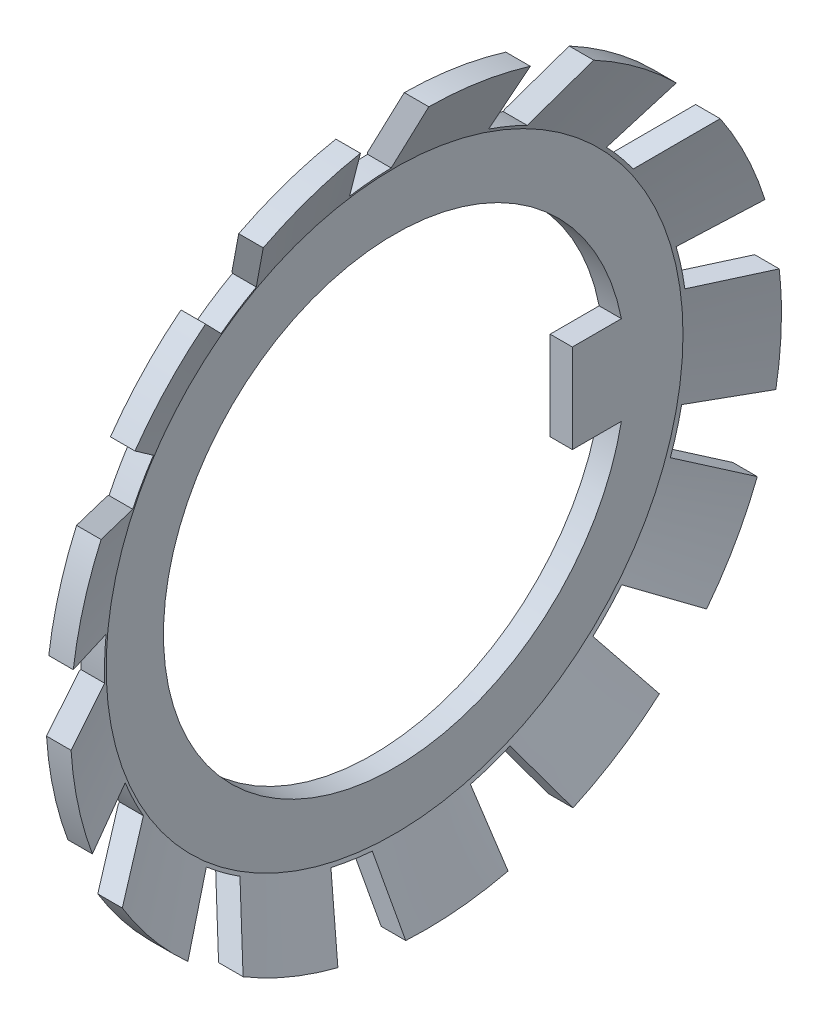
from build123d import *

# Parameters (mm, degrees)
ESQUISSE2_R                  = 13
ENL_V_MAT_EXTRU_1_DEPTH      = 29.444119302
ESQUISSE4_W                  = 4
ESQUISSE4_H                  = 5
BOSS_EXTRU_1_DEPTH           = 1.25
ENL_V_MAT_EXTRU_6_DEPTH      = 29.444119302
R_P_TITION_CIRCULAIRE3_COUNT = 13
R_P_TITION_CIRCULAIRE3_ANGLE = 332.28


with BuildPart() as part:
    # Esquisse1 → Base-R_volution (revolve)
    with BuildSketch(Plane.XY, mode=Mode.PRIVATE) as base_r_volution_sk:
        Polygon((0, 0), (0, 16.5), (1.632076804, 20), (3.011299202, 20), (1.25, 16.222881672), (1.25, 0), align=None)
    revolve(base_r_volution_sk.sketch.rotate(Axis((0, 0, 0), (-1, 0, 0)), 90), axis=Axis((0, 0, 0), (-1, 0, 0)))

    # Esquisse2 → Enl_v. mat.-Extru.1 (cut, through all)
    with BuildSketch(Plane.ZY):
        Circle(ESQUISSE2_R)
    extrude(amount=-ENL_V_MAT_EXTRU_1_DEPTH, mode=Mode.SUBTRACT)

    # Esquisse4 → Boss.-Extru.1 (add)
    with BuildSketch(Plane.ZY):
        with Locations((-12, 0)):
            Rectangle(ESQUISSE4_W, ESQUISSE4_H)
    extrude(amount=-BOSS_EXTRU_1_DEPTH)

    # Esquisse6 → Enl_v. mat.-Extru.6 (cut, through all)
    with BuildSketch(Plane.ZY):
        with BuildLine():
            Line((-16.244922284, 2.25), (-21.281388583, 2.25))
            ThreePointArc((-21.281388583, 2.25), (-20.932358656, 4.449310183), (-20.356673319, 6.600443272))
            Line((-20.356673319, 6.600443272), (-15.755632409, 4.551927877))
            ThreePointArc((-15.755632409, 4.551927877), (-16.041620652, 3.409751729), (-16.244922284, 2.25))
        make_face()
    enl_v_mat_extru_6 = extrude(amount=-ENL_V_MAT_EXTRU_6_DEPTH, mode=Mode.SUBTRACT)

    # R_p_tition circulaire3: Enl_v. mat.-Extru.6 ×13 about axis
    r_p_tition_circulaire3_axis = Axis((0, 0, 0), (1, 0, 0))
    for i in range(1, R_P_TITION_CIRCULAIRE3_COUNT):
        add(enl_v_mat_extru_6.rotate(r_p_tition_circulaire3_axis, i * R_P_TITION_CIRCULAIRE3_ANGLE / (R_P_TITION_CIRCULAIRE3_COUNT - 1)), mode=Mode.SUBTRACT)


solid = part.part
